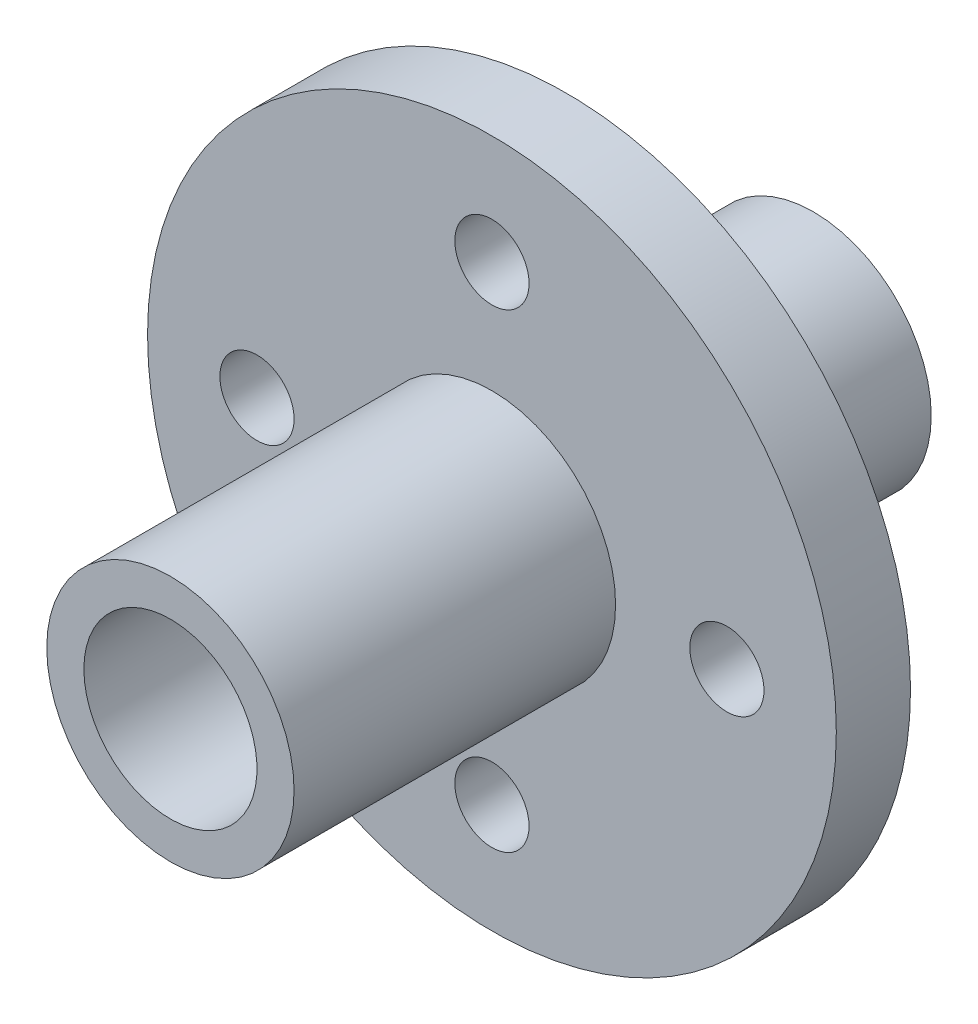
from build123d import *

# Parameters (mm, degrees)
SKETCH1_R               = 13.925
BOSS_EXTRUDE1_DEPTH     = 3
SKETCH2_R               = 5
SKETCH2_R_2             = 3.5
BOSS_EXTRUDE2_DEPTH     = 13
BOSS_EXTRUDE3_START     = 10
SKETCH3_R               = 4.7625
SKETCH3_R_2             = 3.5
BOSS_EXTRUDE3_DEPTH     = 10
CUT_EXTRUDE1_DEPTH      = 26.373435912
CUT_EXTRUDE1_DEPTH_BACK = 26.373435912
SKETCH4_R               = 3.5
CUT_EXTRUDE2_DEPTH      = 26.373435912
CUT_EXTRUDE2_DEPTH_BACK = 26.373435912
SKETCH5_R               = 1.5


with BuildPart() as part:
    # Sketch1 → Boss-Extrude1 (new body)
    with BuildSketch(Plane.XY):
        Circle(SKETCH1_R)
    extrude(amount=BOSS_EXTRUDE1_DEPTH)

    # Sketch2 → Boss-Extrude2 (add)
    with BuildSketch(Plane.XY.offset(3)):
        with Locations(Location((0, 0, 0), (0, 0, 180))):
            Circle(SKETCH2_R)
        with Locations(Location((0, 0, 0), (0, 0, 180))):
            Circle(SKETCH2_R_2, mode=Mode.SUBTRACT)
    extrude(amount=BOSS_EXTRUDE2_DEPTH)

    # Sketch3 → Boss-Extrude3 (add)
    with BuildSketch(Plane(origin=(0, 0, 0), x_dir=(-1, 0, 0), z_dir=(0, 0, -1)).offset(BOSS_EXTRUDE3_START)):
        with Locations(Location((0, 0, 0), (0, 0, 180))):
            Circle(SKETCH3_R)
        Circle(SKETCH3_R_2, mode=Mode.SUBTRACT)
    extrude(amount=-BOSS_EXTRUDE3_DEPTH)

    # Sketch4 → Cut-Extrude1 (cut, two sides: drawn at the far end of the back side and taken through both)
    with BuildSketch(Plane(origin=(0, 0, 0), x_dir=(-1, 0, 0), z_dir=(0, 0, -1)).offset(-CUT_EXTRUDE1_DEPTH_BACK)):
        Circle(SKETCH4_R)
    extrude(amount=CUT_EXTRUDE1_DEPTH + CUT_EXTRUDE1_DEPTH_BACK, mode=Mode.SUBTRACT)

    # Sketch5 → Cut-Extrude2 (cut, two sides: drawn at the far end of the back side and taken through both)
    with BuildSketch(Plane(origin=(0, 0, 0), x_dir=(-1, 0, 0), z_dir=(0, 0, -1)).offset(-CUT_EXTRUDE2_DEPTH_BACK)):
        with Locations(Location((-9.5, 0, 0), (0, 0, 180))):
            Circle(SKETCH5_R)
        with Locations(Location((0, -9.5, 0), (0, 0, 180))):
            Circle(SKETCH5_R)
        with Locations(Location((9.5, 0, 0), (0, 0, 180))):
            Circle(SKETCH5_R)
        with Locations(Location((0, 9.5, 0), (0, 0, 180))):
            Circle(SKETCH5_R)
    extrude(amount=CUT_EXTRUDE2_DEPTH + CUT_EXTRUDE2_DEPTH_BACK, mode=Mode.SUBTRACT)


solid = part.part
